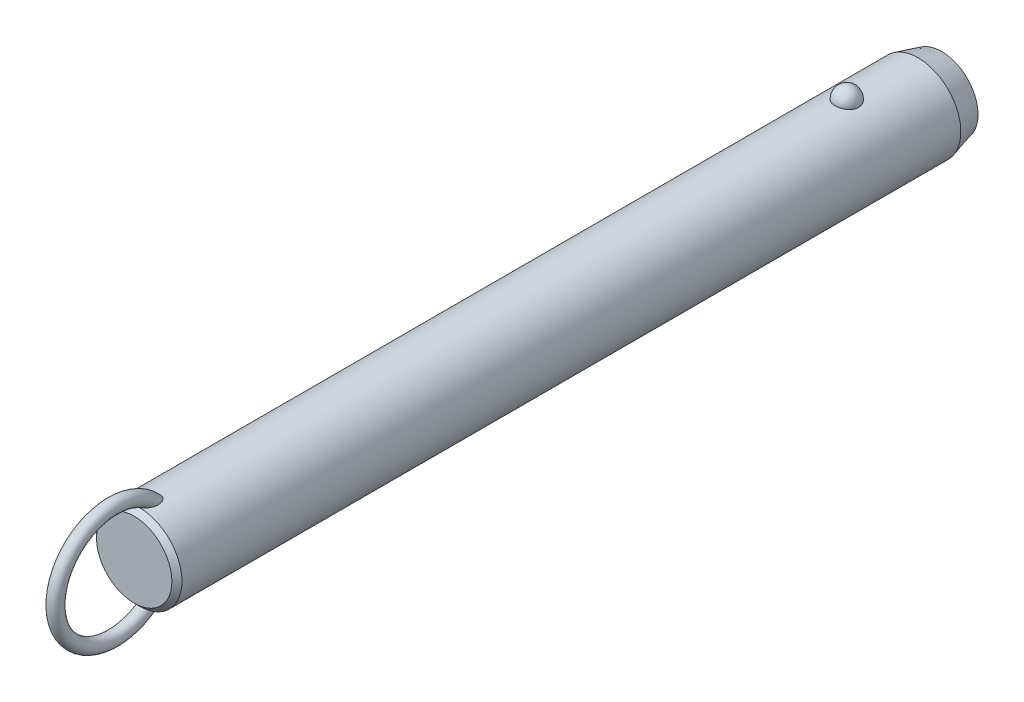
ISO-10303-21;
HEADER;
FILE_DESCRIPTION(('STEP AP214'),'2;1');
FILE_NAME('part.step','',(''),(''),'','','');
FILE_SCHEMA(('AUTOMOTIVE_DESIGN { 1 0 10303 214 1 1 1 1 }'));
ENDSEC;
DATA;
#1=APPLICATION_CONTEXT('core data for automotive mechanical design processes');
#2=APPLICATION_PROTOCOL_DEFINITION('international standard','automotive_design',2000,#1);
#3=PRODUCT_CONTEXT('',#1,'mechanical');
#4=PRODUCT('Part','Part','',(#3));
#5=PRODUCT_RELATED_PRODUCT_CATEGORY('part','',(#4));
#6=PRODUCT_DEFINITION_FORMATION('','',#4);
#7=PRODUCT_DEFINITION_CONTEXT('part definition',#1,'design');
#8=PRODUCT_DEFINITION('design','',#6,#7);
#9=PRODUCT_DEFINITION_SHAPE('','',#8);
#10=(LENGTH_UNIT() NAMED_UNIT(*) SI_UNIT(.MILLI.,.METRE.));
#11=(NAMED_UNIT(*) PLANE_ANGLE_UNIT() SI_UNIT($,.RADIAN.));
#12=(NAMED_UNIT(*) SI_UNIT($,.STERADIAN.) SOLID_ANGLE_UNIT());
#13=UNCERTAINTY_MEASURE_WITH_UNIT(LENGTH_MEASURE(1.E-05),#10,'distance_accuracy_value','');
#14=(GEOMETRIC_REPRESENTATION_CONTEXT(3) GLOBAL_UNCERTAINTY_ASSIGNED_CONTEXT((#13)) GLOBAL_UNIT_ASSIGNED_CONTEXT((#10,
#11,#12)) REPRESENTATION_CONTEXT('',''));
#15=CARTESIAN_POINT('',(0.,0.,0.));
#16=DIRECTION('',(0.,0.,1.));
#17=DIRECTION('',(1.,0.,0.));
#18=AXIS2_PLACEMENT_3D('',#15,#16,#17);
#19=CARTESIAN_POINT('',(0.,0.,195.6));
#20=DIRECTION('',(0.,0.,-1.));
#21=DIRECTION('',(-1.,0.,0.));
#22=AXIS2_PLACEMENT_3D('',#19,#20,#21);
#23=CYLINDRICAL_SURFACE('',#22,12.7);
#24=CARTESIAN_POINT('',(3.46661256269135,12.2177165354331,-3.50000000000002));
#25=CARTESIAN_POINT('',(3.4666090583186,12.2177194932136,-3.30432790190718));
#26=CARTESIAN_POINT('',(3.45063567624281,12.2222841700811,-3.10861112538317));
#27=CARTESIAN_POINT('',(3.38712451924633,12.2400345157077,-2.72271899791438));
#28=CARTESIAN_POINT('',(3.33957415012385,12.2532236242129,-2.53254588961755));
#29=CARTESIAN_POINT('',(3.2141234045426,12.286724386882,-2.16324948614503));
#30=CARTESIAN_POINT('',(3.13623639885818,12.3070329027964,-1.98412136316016));
#31=CARTESIAN_POINT('',(2.95205930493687,12.3525018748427,-1.6418059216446));
#32=CARTESIAN_POINT('',(2.84577003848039,12.3776621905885,-1.47861814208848));
#33=CARTESIAN_POINT('',(2.60688050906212,12.4301712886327,-1.17190583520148));
#34=CARTESIAN_POINT('',(2.47415697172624,12.4575299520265,-1.0284789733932));
#35=CARTESIAN_POINT('',(2.18615174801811,12.5112810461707,-0.766177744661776));
#36=CARTESIAN_POINT('',(2.03087002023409,12.5376734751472,-0.647303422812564));
#37=CARTESIAN_POINT('',(1.70237334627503,12.5864761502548,-0.437732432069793));
#38=CARTESIAN_POINT('',(1.52920948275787,12.6088972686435,-0.346958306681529));
#39=CARTESIAN_POINT('',(1.16944170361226,12.6473352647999,-0.195750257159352));
#40=CARTESIAN_POINT('',(0.982839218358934,12.663352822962,-0.135313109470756));
#41=CARTESIAN_POINT('',(0.604961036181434,12.6869706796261,-0.0473241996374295));
#42=CARTESIAN_POINT('',(0.41382314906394,12.6947125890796,-0.0192185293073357));
#43=CARTESIAN_POINT('',(0.0293827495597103,12.7014203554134,0.00517254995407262));
#44=CARTESIAN_POINT('',(-0.163919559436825,12.7003870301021,0.00146092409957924));
#45=CARTESIAN_POINT('',(-0.544374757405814,12.689735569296,-0.0373939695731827));
#46=CARTESIAN_POINT('',(-0.731575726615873,12.6802364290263,-0.0721015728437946));
#47=CARTESIAN_POINT('',(-1.09733277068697,12.6538333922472,-0.171364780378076));
#48=CARTESIAN_POINT('',(-1.27588869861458,12.6369293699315,-0.235920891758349));
#49=CARTESIAN_POINT('',(-1.6204698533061,12.5973946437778,-0.393548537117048));
#50=CARTESIAN_POINT('',(-1.78641865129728,12.5747321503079,-0.486778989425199));
#51=CARTESIAN_POINT('',(-2.10030671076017,12.5261316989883,-0.699110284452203));
#52=CARTESIAN_POINT('',(-2.24824419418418,12.5001934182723,-0.818213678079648));
#53=CARTESIAN_POINT('',(-2.52491489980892,12.4472906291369,-1.0815712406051));
#54=CARTESIAN_POINT('',(-2.65324222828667,12.4203160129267,-1.22624992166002));
#55=CARTESIAN_POINT('',(-2.88410007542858,12.3687509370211,-1.53528325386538));
#56=CARTESIAN_POINT('',(-2.98662883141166,12.3441606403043,-1.69963924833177));
#57=CARTESIAN_POINT('',(-3.16432417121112,12.2998199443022,-2.04548497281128));
#58=CARTESIAN_POINT('',(-3.23917525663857,12.2801261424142,-2.22714424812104));
#59=CARTESIAN_POINT('',(-3.35800573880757,12.248167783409,-2.60091389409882));
#60=CARTESIAN_POINT('',(-3.4019860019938,12.2359030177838,-2.79302397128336));
#61=CARTESIAN_POINT('',(-3.45784812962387,12.2202347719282,-3.18140279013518));
#62=CARTESIAN_POINT('',(-3.46986123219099,12.2167950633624,-3.37765118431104));
#63=CARTESIAN_POINT('',(-3.46186273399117,12.2190638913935,-3.76943689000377));
#64=CARTESIAN_POINT('',(-3.44185196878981,12.2247721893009,-3.96497421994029));
#65=CARTESIAN_POINT('',(-3.37048652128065,12.2446381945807,-4.34881728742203));
#66=CARTESIAN_POINT('',(-3.31928253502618,12.2587552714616,-4.53715319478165));
#67=CARTESIAN_POINT('',(-3.18693461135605,12.2938237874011,-4.9023172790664));
#68=CARTESIAN_POINT('',(-3.1057895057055,12.3147754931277,-5.07914500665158));
#69=CARTESIAN_POINT('',(-2.91506431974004,12.3613125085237,-5.41732059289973));
#70=CARTESIAN_POINT('',(-2.80533587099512,12.3869217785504,-5.57858147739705));
#71=CARTESIAN_POINT('',(-2.560414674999,12.4398525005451,-5.88013283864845));
#72=CARTESIAN_POINT('',(-2.42522099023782,12.4671740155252,-6.02042254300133));
#73=CARTESIAN_POINT('',(-2.1323357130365,12.5205965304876,-6.27662798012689));
#74=CARTESIAN_POINT('',(-1.97456596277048,12.5466928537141,-6.39245542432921));
#75=CARTESIAN_POINT('',(-1.64115839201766,12.5946384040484,-6.59583547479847));
#76=CARTESIAN_POINT('',(-1.46552179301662,12.6164879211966,-6.68339001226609));
#77=CARTESIAN_POINT('',(-1.10356050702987,12.6532533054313,-6.82682153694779));
#78=CARTESIAN_POINT('',(-0.9173913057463,12.6682500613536,-6.88306988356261));
#79=CARTESIAN_POINT('',(-0.537836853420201,12.6900288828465,-6.96386887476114));
#80=CARTESIAN_POINT('',(-0.344452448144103,12.6968119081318,-6.98842322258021));
#81=CARTESIAN_POINT('',(0.0402577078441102,12.7013667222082,-7.00496469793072));
#82=CARTESIAN_POINT('',(0.231556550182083,12.6993008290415,-6.99753844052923));
#83=CARTESIAN_POINT('',(0.610105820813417,12.6867505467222,-6.95166366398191));
#84=CARTESIAN_POINT('',(0.797356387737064,12.6762664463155,-6.91321620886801));
#85=CARTESIAN_POINT('',(1.16186657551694,12.6480587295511,-6.80658431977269));
#86=CARTESIAN_POINT('',(1.33915951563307,12.6303611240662,-6.73850666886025));
#87=CARTESIAN_POINT('',(1.67968518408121,12.5896027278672,-6.57450875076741));
#88=CARTESIAN_POINT('',(1.84291705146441,12.5665416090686,-6.47858678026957));
#89=CARTESIAN_POINT('',(2.15340192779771,12.5171072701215,-6.25982455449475));
#90=CARTESIAN_POINT('',(2.30037831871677,12.4906895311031,-6.13660186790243));
#91=CARTESIAN_POINT('',(2.5717412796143,12.4376567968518,-5.86739587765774));
#92=CARTESIAN_POINT('',(2.69612388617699,12.4110417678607,-5.72140858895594));
#93=CARTESIAN_POINT('',(2.92107785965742,12.360051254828,-5.40794137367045));
#94=CARTESIAN_POINT('',(3.02121329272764,12.3357209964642,-5.24014110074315));
#95=CARTESIAN_POINT('',(3.19236291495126,12.2925446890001,-4.88969865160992));
#96=CARTESIAN_POINT('',(3.26338839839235,12.2736965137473,-4.70706226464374));
#97=CARTESIAN_POINT('',(3.36788038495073,12.245404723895,-4.35469510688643));
#98=CARTESIAN_POINT('',(3.40484026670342,12.2351018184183,-4.18605935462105));
#99=CARTESIAN_POINT('',(3.45420764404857,12.2212564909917,-3.84496058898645));
#100=CARTESIAN_POINT('',(3.46661565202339,12.2177139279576,-3.67249765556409));
#101=CARTESIAN_POINT('',(3.46661256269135,12.2177165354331,-3.50000000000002));
#102=B_SPLINE_CURVE_WITH_KNOTS('',3,(#24,#25,#26,#27,#28,#29,#30,#31,#32,#33,#34,#35,#36,#37,
#38,#39,#40,#41,#42,#43,#44,#45,#46,#47,#48,#49,#50,#51,#52,#53,#54,#55,#56,#57,#58,#59,#60,#61,
#62,#63,#64,#65,#66,#67,#68,#69,#70,#71,#72,#73,#74,#75,#76,#77,#78,#79,#80,#81,#82,#83,#84,#85,
#86,#87,#88,#89,#90,#91,#92,#93,#94,#95,#96,#97,#98,#99,#100,#101),.UNSPECIFIED.,.T.,.F.,(4,2,2,
2,2,2,2,2,2,2,2,2,2,2,2,2,2,2,2,2,2,2,2,2,2,2,2,2,2,2,2,2,2,2,2,2,2,2,4),(0.,0.586396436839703,
1.17302689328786,1.7593990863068,2.34575431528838,2.93491084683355,3.52406845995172,
4.11158733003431,4.69904375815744,5.2762784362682,5.85345931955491,6.42265312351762,
6.99185659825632,7.56427334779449,8.136746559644,8.71981013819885,9.3029135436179,
9.89247258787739,10.4820150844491,11.0691335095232,11.6562366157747,12.2405256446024,
12.8248374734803,13.412244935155,13.9996740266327,14.5891883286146,15.1786623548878,
15.7609861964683,16.3432419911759,16.9148635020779,17.4864654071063,18.0560241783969,
18.6256177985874,19.2037609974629,19.7820055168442,20.3699810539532,20.957728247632,
21.4746855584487,21.9916320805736),.UNSPECIFIED.);
#103=CARTESIAN_POINT('',(3.46661256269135,12.2177165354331,-3.50000000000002));
#104=VERTEX_POINT('',#103);
#105=EDGE_CURVE('E41',#104,#104,#102,.T.);
#106=ORIENTED_EDGE('',*,*,#105,.T.);
#107=EDGE_LOOP('',(#106));
#108=FACE_BOUND('',#107,.T.);
#109=CARTESIAN_POINT('',(0.,0.,206.8));
#110=DIRECTION('',(0.,0.,1.));
#111=DIRECTION('',(1.,0.,0.));
#112=AXIS2_PLACEMENT_3D('',#109,#110,#111);
#113=CIRCLE('',#112,12.7);
#114=CARTESIAN_POINT('',(12.7,0.,206.8));
#115=VERTEX_POINT('',#114);
#116=EDGE_CURVE('E10',#115,#115,#113,.F.);
#117=ORIENTED_EDGE('',*,*,#116,.T.);
#118=EDGE_LOOP('',(#117));
#119=FACE_BOUND('',#118,.T.);
#120=CARTESIAN_POINT('',(-0.548122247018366,-12.6881662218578,200.543218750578));
#121=CARTESIAN_POINT('',(-0.648865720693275,-12.6838128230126,200.577926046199));
#122=CARTESIAN_POINT('',(-0.746398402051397,-12.6783867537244,200.622042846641));
#123=CARTESIAN_POINT('',(-0.932125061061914,-12.666091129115,200.726764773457));
#124=CARTESIAN_POINT('',(-1.02030388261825,-12.6592192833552,200.787396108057));
#125=CARTESIAN_POINT('',(-1.18487740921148,-12.6448747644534,200.921847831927));
#126=CARTESIAN_POINT('',(-1.26134296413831,-12.637406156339,200.995582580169));
#127=CARTESIAN_POINT('',(-1.4023120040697,-12.6225412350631,201.153604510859));
#128=CARTESIAN_POINT('',(-1.466814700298,-12.6151449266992,201.23789238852));
#129=CARTESIAN_POINT('',(-1.60714786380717,-12.5981718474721,201.449657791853));
#130=CARTESIAN_POINT('',(-1.67725126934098,-12.588900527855,201.580962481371));
#131=CARTESIAN_POINT('',(-1.79536591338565,-12.5725964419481,201.853247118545));
#132=CARTESIAN_POINT('',(-1.84333535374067,-12.5655679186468,201.994244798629));
#133=CARTESIAN_POINT('',(-1.93422576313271,-12.5519624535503,202.337645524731));
#134=CARTESIAN_POINT('',(-1.96788773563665,-12.5466298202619,202.542557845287));
#135=CARTESIAN_POINT('',(-1.9941399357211,-12.542463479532,202.851760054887));
#136=CARTESIAN_POINT('',(-1.99883864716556,-12.5417153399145,202.955298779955));
#137=CARTESIAN_POINT('',(-2.00078003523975,-12.5414074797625,203.16245124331));
#138=CARTESIAN_POINT('',(-1.99802449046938,-12.5418474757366,203.266064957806));
#139=CARTESIAN_POINT('',(-1.98336733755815,-12.5441750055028,203.51032076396));
#140=CARTESIAN_POINT('',(-1.96851430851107,-12.5465291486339,203.650780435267));
#141=CARTESIAN_POINT('',(-1.92707089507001,-12.5529612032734,203.929960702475));
#142=CARTESIAN_POINT('',(-1.90047458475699,-12.5570399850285,204.068680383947));
#143=CARTESIAN_POINT('',(-1.8361912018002,-12.5666008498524,204.34341135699));
#144=CARTESIAN_POINT('',(-1.79850828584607,-12.57208240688,204.479423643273));
#145=CARTESIAN_POINT('',(-1.71223796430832,-12.5841228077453,204.747842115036));
#146=CARTESIAN_POINT('',(-1.66365679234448,-12.5906810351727,204.880250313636));
#147=CARTESIAN_POINT('',(-1.5780450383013,-12.6016176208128,205.08548877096));
#148=CARTESIAN_POINT('',(-1.54477252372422,-12.6057501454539,205.159914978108));
#149=CARTESIAN_POINT('',(-1.47424480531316,-12.6141930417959,205.306839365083));
#150=CARTESIAN_POINT('',(-1.436990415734,-12.6185033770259,205.379337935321));
#151=CARTESIAN_POINT('',(-1.35825795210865,-12.6272207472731,205.521892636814));
#152=CARTESIAN_POINT('',(-1.31678520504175,-12.6316276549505,205.591951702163));
#153=CARTESIAN_POINT('',(-1.22917793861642,-12.6404532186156,205.729070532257));
#154=CARTESIAN_POINT('',(-1.18304514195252,-12.6448718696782,205.796131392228));
#155=CARTESIAN_POINT('',(-1.0724641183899,-12.6547893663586,205.943874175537));
#156=CARTESIAN_POINT('',(-1.00642239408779,-12.6602600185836,206.023384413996));
#157=CARTESIAN_POINT('',(-0.864441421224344,-12.6707460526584,206.173169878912));
#158=CARTESIAN_POINT('',(-0.788516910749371,-12.6757620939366,206.243458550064));
#159=CARTESIAN_POINT('',(-0.652215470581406,-12.6833591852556,206.348680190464));
#160=CARTESIAN_POINT('',(-0.594982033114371,-12.6861973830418,206.387624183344));
#161=CARTESIAN_POINT('',(-0.475269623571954,-12.6912445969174,206.456489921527));
#162=CARTESIAN_POINT('',(-0.412800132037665,-12.6934547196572,206.486427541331));
#163=CARTESIAN_POINT('',(-0.29574972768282,-12.6966636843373,206.52975652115));
#164=CARTESIAN_POINT('',(-0.241949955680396,-12.6978134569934,206.545218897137));
#165=CARTESIAN_POINT('',(-0.132508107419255,-12.6994261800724,206.566884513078));
#166=CARTESIAN_POINT('',(-0.0768679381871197,-12.6998898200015,206.573097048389));
#167=CARTESIAN_POINT('',(0.03476966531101,-12.7000752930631,206.575583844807));
#168=CARTESIAN_POINT('',(0.0907676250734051,-12.6997954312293,206.571835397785));
#169=CARTESIAN_POINT('',(0.201283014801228,-12.6985255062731,206.554788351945));
#170=CARTESIAN_POINT('',(0.255799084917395,-12.6975348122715,206.541481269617));
#171=CARTESIAN_POINT('',(0.376042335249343,-12.6946091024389,206.50203792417));
#172=CARTESIAN_POINT('',(0.440950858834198,-12.6924943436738,206.473449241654));
#173=CARTESIAN_POINT('',(0.565350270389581,-12.6875639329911,206.406323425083));
#174=CARTESIAN_POINT('',(0.624828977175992,-12.6847467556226,206.367764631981));
#175=CARTESIAN_POINT('',(0.774116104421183,-12.6767252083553,206.256949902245));
#176=CARTESIAN_POINT('',(0.859449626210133,-12.6711344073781,206.178760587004));
#177=CARTESIAN_POINT('',(1.01789440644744,-12.6593922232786,206.010943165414));
#178=CARTESIAN_POINT('',(1.09096902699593,-12.653239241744,205.921282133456));
#179=CARTESIAN_POINT('',(1.22268793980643,-12.6411674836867,205.740265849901));
#180=CARTESIAN_POINT('',(1.28193986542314,-12.6352572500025,205.649345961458));
#181=CARTESIAN_POINT('',(1.39259777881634,-12.6235401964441,205.462792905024));
#182=CARTESIAN_POINT('',(1.44399707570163,-12.6177334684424,205.367155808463));
#183=CARTESIAN_POINT('',(1.53972870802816,-12.6064093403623,205.172273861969));
#184=CARTESIAN_POINT('',(1.58405262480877,-12.6008922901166,205.073024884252));
#185=CARTESIAN_POINT('',(1.66600705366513,-12.5903187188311,204.871772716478));
#186=CARTESIAN_POINT('',(1.70363651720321,-12.5852622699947,204.769769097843));
#187=CARTESIAN_POINT('',(1.77545379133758,-12.5753406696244,204.554358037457));
#188=CARTESIAN_POINT('',(1.80903453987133,-12.5705328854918,204.440745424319));
#189=CARTESIAN_POINT('',(1.86844163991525,-12.5618400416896,204.211457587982));
#190=CARTESIAN_POINT('',(1.89426665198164,-12.5579551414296,204.095782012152));
#191=CARTESIAN_POINT('',(1.9378546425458,-12.5513030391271,203.863007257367));
#192=CARTESIAN_POINT('',(1.9556264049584,-12.5485346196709,203.745909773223));
#193=CARTESIAN_POINT('',(1.98264463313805,-12.5442934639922,203.510747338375));
#194=CARTESIAN_POINT('',(1.99189298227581,-12.5428204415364,203.39268260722));
#195=CARTESIAN_POINT('',(2.00416068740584,-12.540871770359,203.080622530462));
#196=CARTESIAN_POINT('',(1.99944433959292,-12.541631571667,202.886229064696));
#197=CARTESIAN_POINT('',(1.96113755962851,-12.5476846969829,202.500309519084));
#198=CARTESIAN_POINT('',(1.92758341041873,-12.5529723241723,202.308780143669));
#199=CARTESIAN_POINT('',(1.83934342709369,-12.5661532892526,201.982272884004));
#200=CARTESIAN_POINT('',(1.79215440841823,-12.5730485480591,201.84524997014));
#201=CARTESIAN_POINT('',(1.67676242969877,-12.588958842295,201.580445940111));
#202=CARTESIAN_POINT('',(1.60859050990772,-12.597970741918,201.452651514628));
#203=CARTESIAN_POINT('',(1.46583832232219,-12.6152829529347,201.235800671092));
#204=CARTESIAN_POINT('',(1.39525727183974,-12.6233659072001,201.14410500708));
#205=CARTESIAN_POINT('',(1.23992594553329,-12.6395676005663,200.973485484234));
#206=CARTESIAN_POINT('',(1.15517932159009,-12.6476863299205,200.894558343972));
#207=CARTESIAN_POINT('',(0.971995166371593,-12.6630846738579,200.752643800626));
#208=CARTESIAN_POINT('',(0.873456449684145,-12.6703572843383,200.689784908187));
#209=CARTESIAN_POINT('',(0.665847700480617,-12.6829569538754,200.584487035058));
#210=CARTESIAN_POINT('',(0.556784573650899,-12.688285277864,200.542034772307));
#211=CARTESIAN_POINT('',(0.347338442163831,-12.6956226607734,200.484443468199));
#212=CARTESIAN_POINT('',(0.247759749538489,-12.6979816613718,200.466399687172));
#213=CARTESIAN_POINT('',(0.0470218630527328,-12.7003077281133,200.448600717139));
#214=CARTESIAN_POINT('',(-0.0541350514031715,-12.7002779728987,200.448821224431));
#215=CARTESIAN_POINT('',(-0.221414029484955,-12.6982482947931,200.464363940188));
#216=CARTESIAN_POINT('',(-0.288055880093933,-12.6969033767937,200.474666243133));
#217=CARTESIAN_POINT('',(-0.419599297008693,-12.6932369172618,200.50313489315));
#218=CARTESIAN_POINT('',(-0.484501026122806,-12.6909154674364,200.521300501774));
#219=CARTESIAN_POINT('',(-0.548122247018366,-12.6881662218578,200.543218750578));
#220=B_SPLINE_CURVE_WITH_KNOTS('',3,(#120,#121,#122,#123,#124,#125,#126,#127,#128,#129,#130,
#131,#132,#133,#134,#135,#136,#137,#138,#139,#140,#141,#142,#143,#144,#145,#146,#147,#148,#149,
#150,#151,#152,#153,#154,#155,#156,#157,#158,#159,#160,#161,#162,#163,#164,#165,#166,#167,#168,
#169,#170,#171,#172,#173,#174,#175,#176,#177,#178,#179,#180,#181,#182,#183,#184,#185,#186,#187,
#188,#189,#190,#191,#192,#193,#194,#195,#196,#197,#198,#199,#200,#201,#202,#203,#204,#205,#206,
#207,#208,#209,#210,#211,#212,#213,#214,#215,#216,#217,#218,#219),.UNSPECIFIED.,.T.,.F.,(4,2,2,
2,2,2,2,2,2,2,2,2,2,2,2,2,2,2,2,2,2,2,2,2,2,2,2,2,2,2,2,2,2,2,2,2,2,2,2,2,2,2,2,2,2,2,2,2,2,4),
(0.,0.31964225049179,0.639794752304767,0.957927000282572,1.27608021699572,1.72100165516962,
2.16675988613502,2.78630021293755,3.09705782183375,3.40774128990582,3.8309635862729,
4.25439969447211,4.67767724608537,5.10071330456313,5.34550297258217,5.59024267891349,
5.83467707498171,6.07902143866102,6.38891080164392,6.69834321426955,6.90560910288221,
7.11250749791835,7.27977315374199,7.44687060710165,7.61434932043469,7.78197685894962,
7.99365544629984,8.20579780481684,8.55147335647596,8.89816429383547,9.22375138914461,
9.54961437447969,9.87586224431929,10.202161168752,10.557587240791,10.9130746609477,
11.2681734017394,11.6231936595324,12.2046601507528,12.7853961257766,13.219164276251,
13.6522938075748,13.9989174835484,14.3454519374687,14.6946768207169,15.0436740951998,
15.3457513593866,15.6474266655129,15.8493051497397,16.0511646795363),.UNSPECIFIED.);
#221=CARTESIAN_POINT('',(-0.548122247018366,-12.6881662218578,200.543218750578));
#222=VERTEX_POINT('',#221);
#223=EDGE_CURVE('E59',#222,#222,#220,.T.);
#224=ORIENTED_EDGE('',*,*,#223,.T.);
#225=EDGE_LOOP('',(#224));
#226=FACE_BOUND('',#225,.T.);
#227=CARTESIAN_POINT('',(-0.548122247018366,12.6881662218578,200.543218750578));
#228=CARTESIAN_POINT('',(-0.459436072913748,12.6919968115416,200.512673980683));
#229=CARTESIAN_POINT('',(-0.368189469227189,12.6949996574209,200.489391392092));
#230=CARTESIAN_POINT('',(-0.183024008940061,12.6990186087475,200.458406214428));
#231=CARTESIAN_POINT('',(-0.0891049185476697,12.7000345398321,200.450704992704));
#232=CARTESIAN_POINT('',(0.098714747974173,12.6999636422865,200.451245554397));
#233=CARTESIAN_POINT('',(0.192615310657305,12.6988761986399,200.459492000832));
#234=CARTESIAN_POINT('',(0.377658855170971,12.6947211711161,200.491551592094));
#235=CARTESIAN_POINT('',(0.468801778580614,12.6916535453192,200.515365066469));
#236=CARTESIAN_POINT('',(0.645809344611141,12.6838788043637,200.57745651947));
#237=CARTESIAN_POINT('',(0.731679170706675,12.6791733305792,200.615720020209));
#238=CARTESIAN_POINT('',(0.896315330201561,12.6686004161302,200.705120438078));
#239=CARTESIAN_POINT('',(0.975080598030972,12.6627328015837,200.756259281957));
#240=CARTESIAN_POINT('',(1.12963655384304,12.6499161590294,200.87367820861));
#241=CARTESIAN_POINT('',(1.20478673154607,12.6429194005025,200.940792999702));
#242=CARTESIAN_POINT('',(1.34448241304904,12.6288282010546,201.08522507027));
#243=CARTESIAN_POINT('',(1.40902173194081,12.621733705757,201.162548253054));
#244=CARTESIAN_POINT('',(1.55208211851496,12.6050877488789,201.359247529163));
#245=CARTESIAN_POINT('',(1.62510490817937,12.5957546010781,201.482654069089));
#246=CARTESIAN_POINT('',(1.7501904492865,12.5789823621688,201.739769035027));
#247=CARTESIAN_POINT('',(1.80221377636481,12.5715468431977,201.873496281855));
#248=CARTESIAN_POINT('',(1.90309965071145,12.5567434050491,202.198351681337));
#249=CARTESIAN_POINT('',(1.94342317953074,12.5504515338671,202.392161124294));
#250=CARTESIAN_POINT('',(1.99332997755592,12.5426147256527,202.78378810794));
#251=CARTESIAN_POINT('',(2.00285305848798,12.5410790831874,202.981612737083));
#252=CARTESIAN_POINT('',(1.99678999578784,12.5420407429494,203.316642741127));
#253=CARTESIAN_POINT('',(1.98794117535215,12.5434564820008,203.454042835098));
#254=CARTESIAN_POINT('',(1.95865119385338,12.5480641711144,203.727639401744));
#255=CARTESIAN_POINT('',(1.93820436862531,12.5512569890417,203.863835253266));
#256=CARTESIAN_POINT('',(1.88647896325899,12.5591352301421,204.134249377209));
#257=CARTESIAN_POINT('',(1.85518800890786,12.5638223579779,204.268465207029));
#258=CARTESIAN_POINT('',(1.78217886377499,12.5743868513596,204.533936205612));
#259=CARTESIAN_POINT('',(1.74046509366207,12.5802637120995,204.665192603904));
#260=CARTESIAN_POINT('',(1.66024095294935,12.5910571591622,204.886085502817));
#261=CARTESIAN_POINT('',(1.62434772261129,12.5957535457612,204.976690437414));
#262=CARTESIAN_POINT('',(1.54709009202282,12.6054762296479,205.155512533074));
#263=CARTESIAN_POINT('',(1.50572681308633,12.6105024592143,205.243730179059));
#264=CARTESIAN_POINT('',(1.41728020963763,12.620748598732,205.416932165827));
#265=CARTESIAN_POINT('',(1.37021377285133,12.625967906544,205.501925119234));
#266=CARTESIAN_POINT('',(1.26969620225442,12.6364721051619,205.668007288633));
#267=CARTESIAN_POINT('',(1.21624929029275,12.6417569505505,205.749099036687));
#268=CARTESIAN_POINT('',(1.10304413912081,12.6521331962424,205.904702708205));
#269=CARTESIAN_POINT('',(1.04340936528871,12.657226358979,205.979303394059));
#270=CARTESIAN_POINT('',(0.915919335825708,12.667090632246,206.121324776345));
#271=CARTESIAN_POINT('',(0.848064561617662,12.6718617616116,206.18874589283));
#272=CARTESIAN_POINT('',(0.717035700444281,12.67987711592,206.300624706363));
#273=CARTESIAN_POINT('',(0.655526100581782,12.6832377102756,206.346997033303));
#274=CARTESIAN_POINT('',(0.525985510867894,12.6892676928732,206.429619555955));
#275=CARTESIAN_POINT('',(0.457969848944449,12.6919386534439,206.465892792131));
#276=CARTESIAN_POINT('',(0.334859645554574,12.695691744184,206.516657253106));
#277=CARTESIAN_POINT('',(0.281116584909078,12.6970073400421,206.534373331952));
#278=CARTESIAN_POINT('',(0.171425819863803,12.6989609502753,206.560642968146));
#279=CARTESIAN_POINT('',(0.115480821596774,12.699599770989,206.569207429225));
#280=CARTESIAN_POINT('',(0.00272618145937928,12.7001251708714,206.576253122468));
#281=CARTESIAN_POINT('',(-0.0540859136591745,12.7000089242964,206.574696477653));
#282=CARTESIAN_POINT('',(-0.166544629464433,12.6990328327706,206.561600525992));
#283=CARTESIAN_POINT('',(-0.222190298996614,12.6981724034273,206.550053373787));
#284=CARTESIAN_POINT('',(-0.342018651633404,12.695562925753,206.514912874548));
#285=CARTESIAN_POINT('',(-0.405606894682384,12.6936676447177,206.48933225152));
#286=CARTESIAN_POINT('',(-0.527815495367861,12.6891754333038,206.428311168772));
#287=CARTESIAN_POINT('',(-0.586425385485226,12.6865770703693,206.392850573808));
#288=CARTESIAN_POINT('',(-0.731842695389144,12.6792129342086,206.291496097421));
#289=CARTESIAN_POINT('',(-0.81470941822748,12.6740767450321,206.2200395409));
#290=CARTESIAN_POINT('',(-0.969101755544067,12.6632083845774,206.06589007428));
#291=CARTESIAN_POINT('',(-1.04059564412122,12.6574746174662,205.983166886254));
#292=CARTESIAN_POINT('',(-1.16981116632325,12.6461638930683,205.815809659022));
#293=CARTESIAN_POINT('',(-1.22811369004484,12.6405994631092,205.731616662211));
#294=CARTESIAN_POINT('',(-1.33743405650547,12.6295007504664,205.558579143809));
#295=CARTESIAN_POINT('',(-1.38844577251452,12.6239664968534,205.469730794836));
#296=CARTESIAN_POINT('',(-1.48400702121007,12.6130898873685,205.288389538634));
#297=CARTESIAN_POINT('',(-1.52854232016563,12.6077479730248,205.195889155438));
#298=CARTESIAN_POINT('',(-1.61150113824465,12.5974127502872,205.008160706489));
#299=CARTESIAN_POINT('',(-1.64992317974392,12.5924195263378,204.912931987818));
#300=CARTESIAN_POINT('',(-1.73468589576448,12.581070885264,204.68289362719));
#301=CARTESIAN_POINT('',(-1.77831261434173,12.5749388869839,204.547066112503));
#302=CARTESIAN_POINT('',(-1.85439734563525,12.5639437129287,204.272212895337));
#303=CARTESIAN_POINT('',(-1.88684994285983,12.5590811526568,204.133185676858));
#304=CARTESIAN_POINT('',(-1.94008483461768,12.550968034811,203.85309235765));
#305=CARTESIAN_POINT('',(-1.96088706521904,12.5477147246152,203.712030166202));
#306=CARTESIAN_POINT('',(-1.99000539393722,12.5431291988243,203.428668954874));
#307=CARTESIAN_POINT('',(-1.99832911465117,12.5417958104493,203.286370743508));
#308=CARTESIAN_POINT('',(-2.00166624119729,12.5412674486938,202.957627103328));
#309=CARTESIAN_POINT('',(-1.99178843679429,12.5428579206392,202.771088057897));
#310=CARTESIAN_POINT('',(-1.94455183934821,12.5502731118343,202.40162404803));
#311=CARTESIAN_POINT('',(-1.90724032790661,12.5560905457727,202.218693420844));
#312=CARTESIAN_POINT('',(-1.81330718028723,12.5699462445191,201.904848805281));
#313=CARTESIAN_POINT('',(-1.76338820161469,12.5771273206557,201.771910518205));
#314=CARTESIAN_POINT('',(-1.64305018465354,12.593414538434,201.515681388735));
#315=CARTESIAN_POINT('',(-1.57265346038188,12.6025185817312,201.392380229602));
#316=CARTESIAN_POINT('',(-1.42634956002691,12.6198178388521,201.183564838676));
#317=CARTESIAN_POINT('',(-1.35423772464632,12.6278405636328,201.095384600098));
#318=CARTESIAN_POINT('',(-1.19645664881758,12.6437632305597,200.932107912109));
#319=CARTESIAN_POINT('',(-1.1108053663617,12.6516633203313,200.856994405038));
#320=CARTESIAN_POINT('',(-0.947219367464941,12.6648319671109,200.737811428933));
#321=CARTESIAN_POINT('',(-0.871624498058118,12.670300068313,200.690541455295));
#322=CARTESIAN_POINT('',(-0.714161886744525,12.6801492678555,200.6077413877));
#323=CARTESIAN_POINT('',(-0.632295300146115,12.684530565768,200.57220913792));
#324=CARTESIAN_POINT('',(-0.548122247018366,12.6881662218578,200.543218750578));
#325=B_SPLINE_CURVE_WITH_KNOTS('',3,(#227,#228,#229,#230,#231,#232,#233,#234,#235,#236,#237,
#238,#239,#240,#241,#242,#243,#244,#245,#246,#247,#248,#249,#250,#251,#252,#253,#254,#255,#256,
#257,#258,#259,#260,#261,#262,#263,#264,#265,#266,#267,#268,#269,#270,#271,#272,#273,#274,#275,
#276,#277,#278,#279,#280,#281,#282,#283,#284,#285,#286,#287,#288,#289,#290,#291,#292,#293,#294,
#295,#296,#297,#298,#299,#300,#301,#302,#303,#304,#305,#306,#307,#308,#309,#310,#311,#312,#313,
#314,#315,#316,#317,#318,#319,#320,#321,#322,#323,#324),.UNSPECIFIED.,.T.,.F.,(4,2,2,2,2,2,2,2,
2,2,2,2,2,2,2,2,2,2,2,2,2,2,2,2,2,2,2,2,2,2,2,2,2,2,2,2,2,2,2,2,2,2,2,2,2,2,2,2,4),(0.,
0.281328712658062,0.562682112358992,0.844117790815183,1.12555942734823,1.40671982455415,
1.68792232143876,1.98972294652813,2.29169886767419,2.72039860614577,3.14989948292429,
3.74084916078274,4.33295293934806,4.74554109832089,5.15833092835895,5.57159335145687,
5.98468079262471,6.27722775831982,6.56971484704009,6.86135609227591,7.15280542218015,
7.43927407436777,7.72572595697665,7.95635862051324,8.18646071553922,8.35559393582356,
8.52452541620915,8.6940894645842,8.86378678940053,9.06834348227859,9.27332014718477,
9.60010414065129,9.92778432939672,10.2350252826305,10.5425229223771,10.8506864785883,
11.15892440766,11.5867893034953,12.0148612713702,12.4421984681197,12.8692745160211,
13.4279365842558,13.9856380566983,14.4107062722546,14.835313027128,15.1765567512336,
15.517351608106,15.7844129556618,16.051425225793),.UNSPECIFIED.);
#326=CARTESIAN_POINT('',(-0.548122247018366,12.6881662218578,200.543218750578));
#327=VERTEX_POINT('',#326);
#328=EDGE_CURVE('E67',#327,#327,#325,.T.);
#329=ORIENTED_EDGE('',*,*,#328,.T.);
#330=EDGE_LOOP('',(#329));
#331=FACE_BOUND('',#330,.T.);
#332=CARTESIAN_POINT('',(0.,0.,-24.6999999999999));
#333=DIRECTION('',(0.,0.,-1.));
#334=DIRECTION('',(-1.,0.,0.));
#335=AXIS2_PLACEMENT_3D('',#332,#333,#334);
#336=CIRCLE('',#335,12.7);
#337=CARTESIAN_POINT('',(-12.7,0.,-24.6999999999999));
#338=VERTEX_POINT('',#337);
#339=EDGE_CURVE('E56',#338,#338,#336,.F.);
#340=ORIENTED_EDGE('',*,*,#339,.T.);
#341=EDGE_LOOP('',(#340));
#342=FACE_BOUND('',#341,.T.);
#343=ADVANCED_FACE('F37',(#108,#119,#226,#331,#342),#23,.T.);
#344=CARTESIAN_POINT('',(0.,0.,-31.7));
#345=DIRECTION('',(0.,0.,-1.));
#346=DIRECTION('',(-1.,0.,0.));
#347=AXIS2_PLACEMENT_3D('',#344,#345,#346);
#348=PLANE('',#347);
#349=CARTESIAN_POINT('',(0.,0.,-31.7));
#350=DIRECTION('',(0.,0.,-1.));
#351=DIRECTION('',(-1.,0.,0.));
#352=AXIS2_PLACEMENT_3D('',#349,#350,#351);
#353=CIRCLE('',#352,10.8243556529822);
#354=CARTESIAN_POINT('',(-10.8243556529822,0.,-31.7));
#355=VERTEX_POINT('',#354);
#356=EDGE_CURVE('E66',#355,#355,#353,.T.);
#357=ORIENTED_EDGE('',*,*,#356,.T.);
#358=EDGE_LOOP('',(#357));
#359=FACE_BOUND('',#358,.T.);
#360=ADVANCED_FACE('F85',(#359),#348,.T.);
#361=CARTESIAN_POINT('',(0.,0.,-31.7));
#362=DIRECTION('',(0.,0.,1.));
#363=DIRECTION('',(1.,0.,0.));
#364=AXIS2_PLACEMENT_3D('',#361,#362,#363);
#365=CONICAL_SURFACE('',#364,10.8243556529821,0.261799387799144);
#366=ORIENTED_EDGE('',*,*,#339,.F.);
#367=EDGE_LOOP('',(#366));
#368=FACE_BOUND('',#367,.T.);
#369=ORIENTED_EDGE('',*,*,#356,.F.);
#370=EDGE_LOOP('',(#369));
#371=FACE_BOUND('',#370,.T.);
#372=ADVANCED_FACE('F83',(#368,#371),#365,.T.);
#373=CARTESIAN_POINT('',(0.,0.,208.3));
#374=DIRECTION('',(0.,0.,1.));
#375=DIRECTION('',(1.,0.,0.));
#376=AXIS2_PLACEMENT_3D('',#373,#374,#375);
#377=PLANE('',#376);
#378=CARTESIAN_POINT('',(0.,0.,208.3));
#379=DIRECTION('',(0.,0.,1.));
#380=DIRECTION('',(1.,0.,0.));
#381=AXIS2_PLACEMENT_3D('',#378,#379,#380);
#382=CIRCLE('',#381,11.1999999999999);
#383=CARTESIAN_POINT('',(11.1999999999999,0.,208.3));
#384=VERTEX_POINT('',#383);
#385=EDGE_CURVE('E50',#384,#384,#382,.T.);
#386=ORIENTED_EDGE('',*,*,#385,.T.);
#387=EDGE_LOOP('',(#386));
#388=FACE_BOUND('',#387,.T.);
#389=ADVANCED_FACE('F77',(#388),#377,.T.);
#390=CARTESIAN_POINT('',(0.,0.,214.65));
#391=DIRECTION('',(1.,0.,0.));
#392=DIRECTION('',(0.,0.,-1.));
#393=AXIS2_PLACEMENT_3D('',#390,#391,#392);
#394=TOROIDAL_SURFACE('',#393,17.05,2.);
#395=ORIENTED_EDGE('',*,*,#328,.F.);
#396=EDGE_LOOP('',(#395));
#397=FACE_BOUND('',#396,.T.);
#398=ORIENTED_EDGE('',*,*,#223,.F.);
#399=EDGE_LOOP('',(#398));
#400=FACE_BOUND('',#399,.T.);
#401=ADVANCED_FACE('F73',(#397,#400),#394,.T.);
#402=CARTESIAN_POINT('',(0.,0.,208.3));
#403=DIRECTION('',(0.,0.,-1.));
#404=DIRECTION('',(-1.,0.,0.));
#405=AXIS2_PLACEMENT_3D('',#402,#403,#404);
#406=CONICAL_SURFACE('',#405,11.1999999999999,0.785398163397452);
#407=ORIENTED_EDGE('',*,*,#116,.F.);
#408=EDGE_LOOP('',(#407));
#409=FACE_BOUND('',#408,.T.);
#410=ORIENTED_EDGE('',*,*,#385,.F.);
#411=EDGE_LOOP('',(#410));
#412=FACE_BOUND('',#411,.T.);
#413=ADVANCED_FACE('F39',(#409,#412),#406,.T.);
#414=CARTESIAN_POINT('',(0.,12.7,-3.50000000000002));
#415=DIRECTION('',(0.,1.,0.));
#416=DIRECTION('',(0.,0.,-1.));
#417=AXIS2_PLACEMENT_3D('',#414,#415,#416);
#418=SPHERICAL_SURFACE('',#417,3.5);
#419=ORIENTED_EDGE('',*,*,#105,.F.);
#420=EDGE_LOOP('',(#419));
#421=FACE_BOUND('',#420,.T.);
#422=ADVANCED_FACE('F79',(#421),#418,.T.);
#423=CLOSED_SHELL('',(#343,#360,#372,#389,#401,#413,#422));
#424=MANIFOLD_SOLID_BREP('B2',#423);
#425=ADVANCED_BREP_SHAPE_REPRESENTATION('',(#18,#424),#14);
#426=SHAPE_DEFINITION_REPRESENTATION(#9,#425);
ENDSEC;
END-ISO-10303-21;
